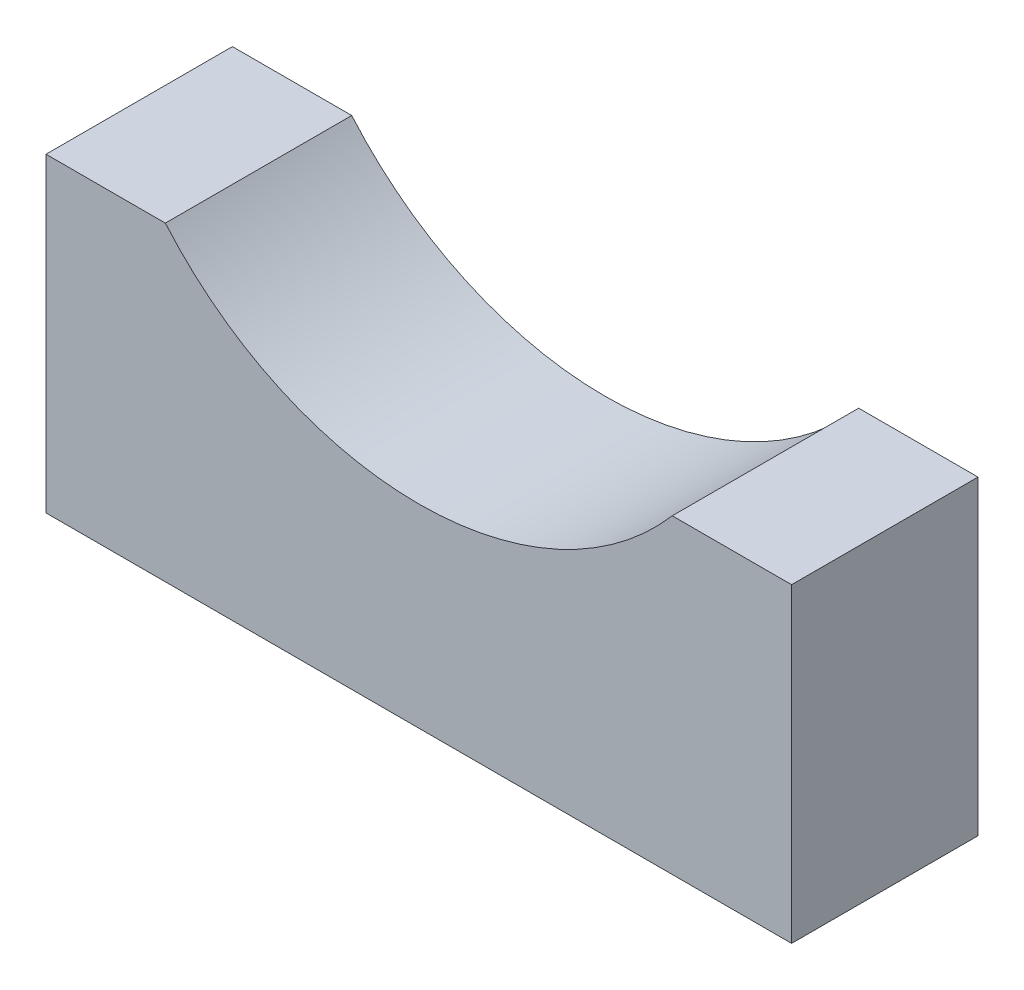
from build123d import *

# Parameters (mm, degrees)
SKETCH1_W                    = 24
SKETCH1_H                    = 10
BOSS_EXTRUDE1_DEPTH          = 6
SKETCH2_R                    = 10.75
CUT_EXTRUDE1_DEPTH           = 15.317821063
M2_5X0_45_TAPPED_HOLE1_D     = 2.05
M2_5X0_45_TAPPED_HOLE1_DEPTH = 5
M2_5X0_45_TAPPED_HOLE1_TIP   = 0.615882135


with BuildPart() as part:
    # Sketch1 → Boss-Extrude1 (new body)
    with BuildSketch(Plane.XY):
        Rectangle(SKETCH1_W, SKETCH1_H)
    extrude(amount=-BOSS_EXTRUDE1_DEPTH)

    # Sketch2 → Cut-Extrude1 (cut, through all)
    with BuildSketch(Plane.XY):
        with Locations((0, 12)):
            Circle(SKETCH2_R)
    extrude(amount=-CUT_EXTRUDE1_DEPTH, mode=Mode.SUBTRACT)

    # M2.5x0.45 Tapped Hole1
    with Locations(Plane(origin=(0, -5, 0), x_dir=(-1, 0, 0), z_dir=(0, -1, 0))):
        with Locations((10.25, 3), (-10.25, 3)):
            Hole(M2_5X0_45_TAPPED_HOLE1_D / 2, depth=M2_5X0_45_TAPPED_HOLE1_DEPTH)
            with Locations((0, 0, -(M2_5X0_45_TAPPED_HOLE1_DEPTH + M2_5X0_45_TAPPED_HOLE1_TIP / 2))):  # 118° drill point
                Cone(0, M2_5X0_45_TAPPED_HOLE1_D / 2, M2_5X0_45_TAPPED_HOLE1_TIP, mode=Mode.SUBTRACT)


solid = part.part
